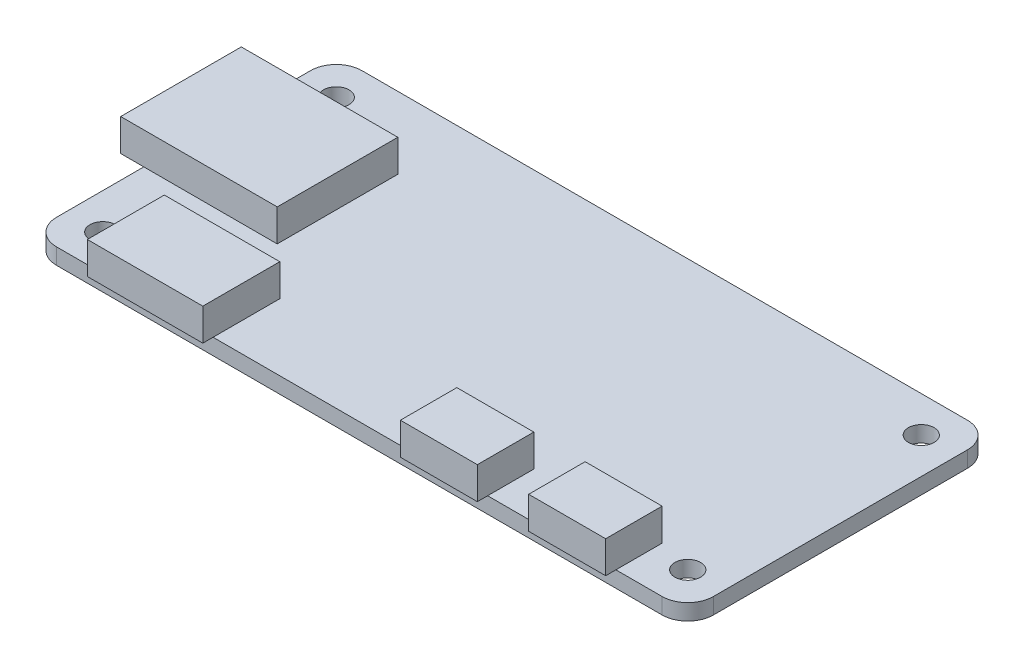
from build123d import *

# Parameters (mm, degrees)
SKETCH1_R           = 1.27
BOSS_EXTRUDE1_DEPTH = 1.5875
SKETCH2_W           = 7.62
SKETCH2_H           = 5.588
SKETCH2_W_2         = 11.43
SKETCH2_H_2         = 7.62
SKETCH2_W_3         = 15.494
SKETCH2_H_3         = 11.938
BOSS_EXTRUDE2_DEPTH = 3.175


with BuildPart() as part:
    # Sketch1 → Boss-Extrude1 (new body)
    with BuildSketch(Plane(origin=(0, 0, 0), x_dir=(1, 0, 0), z_dir=(0, 1, 0))):
        with BuildLine():
            Line((2.54, 0), (62.484, 0))
            ThreePointArc((62.484, 0), (64.280051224, 0.743948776), (65.024, 2.54))
            Line((65.024, 2.54), (65.024, 27.686))
            ThreePointArc((65.024, 27.686), (64.280051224, 29.482051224), (62.484, 30.226))
            Line((62.484, 30.226), (2.54, 30.226))
            ThreePointArc((2.54, 30.226), (0.743948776, 29.482051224), (0, 27.686))
            Line((0, 27.686), (0, 2.54))
            ThreePointArc((0, 2.54), (0.743948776, 0.743948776), (2.54, 0))
        make_face()
        with Locations(Location((3.556, 26.67, 0), (0, 0, 270))):
            Circle(SKETCH1_R, mode=Mode.SUBTRACT)
        with Locations(Location((3.556, 3.556, 0), (0, 0, 270))):
            Circle(SKETCH1_R, mode=Mode.SUBTRACT)
        with Locations(Location((61.468, 3.556, 0), (0, 0, 270))):
            Circle(SKETCH1_R, mode=Mode.SUBTRACT)
        with Locations(Location((61.468, 26.67, 0), (0, 0, 270))):
            Circle(SKETCH1_R, mode=Mode.SUBTRACT)
    extrude(amount=BOSS_EXTRUDE1_DEPTH)

    # Sketch2 → Boss-Extrude2 (add)
    with BuildSketch(Plane(origin=(0, 1.5875, 0), x_dir=(1, 0, 0), z_dir=(0, 1, 0))):
        with Locations((54.102, 1.778)):
            Rectangle(SKETCH2_W, SKETCH2_H)
        with Locations((41.402, 1.778)):
            Rectangle(SKETCH2_W, SKETCH2_H)
        with Locations((12.319, 2.794)):
            Rectangle(SKETCH2_W_2, SKETCH2_H_2)
        with Locations((5.461, 17.145)):
            Rectangle(SKETCH2_W_3, SKETCH2_H_3)
    extrude(amount=BOSS_EXTRUDE2_DEPTH)


solid = part.part
